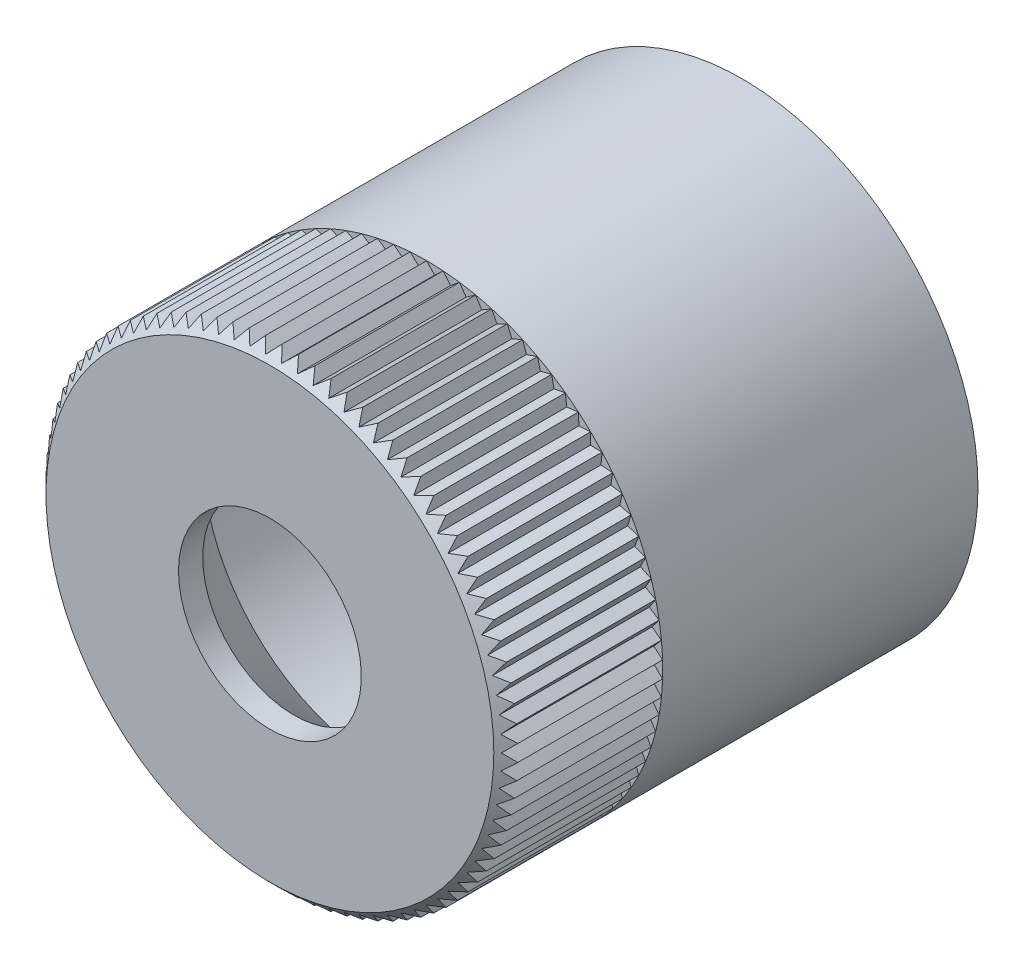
from build123d import *

# Parameters (mm, degrees)
SKETCH1_R           = 6.325
BOSS_EXTRUDE1_DEPTH = 12.65
SKETCH2_R           = 4.8
CUT_EXTRUDE1_DEPTH  = 9.65
SKETCH3_R           = 2.45
CUT_EXTRUDE2_DEPTH  = 14.158029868
CUT_EXTRUDE4_DEPTH  = 4.2
CIRPATTERN1_COUNT   = 90
CHAMFER1_SIZE       = 0.5
SKETCH7_R           = 0.8
SKETCH10_OUTSIDE_W  = 52.018
SKETCH10_OUTSIDE_H  = 52.018
SKETCH10_OUTSIDE_R  = 6
CUT_EXTRUDE7_DEPTH  = 16.493022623
CUT_EXTRUDE7_DRAFT  = -45


with BuildPart() as part:
    # Sketch1 → Boss-Extrude1 (new body)
    with BuildSketch(Plane.XY):
        Circle(SKETCH1_R)
    extrude(amount=BOSS_EXTRUDE1_DEPTH)

    # Sketch2 → Cut-Extrude1 (cut)
    with BuildSketch(Plane(origin=(0, 0, 0), x_dir=(-1, 0, 0), z_dir=(0, 0, -1))):
        Circle(SKETCH2_R)
    extrude(amount=-CUT_EXTRUDE1_DEPTH, mode=Mode.SUBTRACT)

    # Sketch3 → Cut-Extrude2 (cut, through all)
    with BuildSketch(Plane(origin=(0, 0, 9.65), x_dir=(-1, 0, 0), z_dir=(0, 0, -1))):
        Circle(SKETCH3_R)
    extrude(amount=-CUT_EXTRUDE2_DEPTH, mode=Mode.SUBTRACT)

    # Cut-Extrude3 cone 1 section (on through the dimple's axis) → Cut-Extrude3 (revolve, cut)
    with BuildSketch(Plane(origin=(0, 0, 9.65), x_dir=(0, 1, 0), z_dir=(1, 0, 0))):
        Polygon((0, 0), (4.8, 0), (0, 4.8), align=None)
    revolve(axis=Axis((0, 0, 9.65), (0, 0, 1)), mode=Mode.SUBTRACT)

    # Sketch5 → Cut-Extrude4 (cut)
    with BuildSketch(Plane.XY.offset(12.65)):
        with BuildLine():
            Line((0, 6.325), (0.212901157, 6.096691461))
            Line((0.212901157, 6.096691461), (0.441209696, 6.309592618))
            ThreePointArc((0.441209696, 6.309592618), (0.239203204, 6.849883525), (0, 6.325))
        make_face()
    cut_extrude4 = extrude(amount=-CUT_EXTRUDE4_DEPTH, mode=Mode.SUBTRACT)

    # CirPattern1: Cut-Extrude4 ×90 about axis
    cirpattern1_axis = Axis((0, 0, 0), (0, 0, 1))
    for i in range(1, CIRPATTERN1_COUNT):
        add(cut_extrude4.rotate(cirpattern1_axis, i * 360 / CIRPATTERN1_COUNT), mode=Mode.SUBTRACT)

    # Chamfer1
    chamfer1_edges = [part.edges().sort_by_distance(p)[0] for p in [
        (4.8, 0, 0),
    ]]
    chamfer(chamfer1_edges, length=CHAMFER1_SIZE)

    # Sketch7 → Cut-Revolve1 (revolve, cut)
    with BuildSketch(Plane(origin=(0, 0, 0), x_dir=(0, 0, -1), z_dir=(1, 0, 0)), mode=Mode.PRIVATE) as cut_revolve1_sk:
        with Locations((-1.8, 4.8)):
            Circle(SKETCH7_R)
    revolve(cut_revolve1_sk.sketch.rotate(Axis((0, 0, 12.65), (0, 0, -1)), 90), axis=Axis((0, 0, 12.65), (0, 0, -1)), mode=Mode.SUBTRACT)


with BuildPart() as cut_extrude7_tool:
    # Sketch10 outside → Cut-Extrude7 (with draft: the straight prism first)
    with BuildSketch(Plane.XY.offset(12.65)):
        Rectangle(SKETCH10_OUTSIDE_W, SKETCH10_OUTSIDE_H)
        Circle(SKETCH10_OUTSIDE_R, mode=Mode.SUBTRACT)
    extrude(amount=-CUT_EXTRUDE7_DEPTH)
    # Cut-Extrude7: the draft: its side faces are tilted about the plane it starts from
    cut_extrude7_sides = [cut_extrude7_tool.faces().sort_by_distance(p)[0] for p in [
        (0, -26.009, 4.403488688),
        (26.009, 0, 4.403488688),
        (0, 26.009, 4.403488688),
        (-26.009, 0, 4.403488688),
        (-6, 0, 4.403488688),
    ]]
    draft(cut_extrude7_sides, Plane.XY.offset(12.65), CUT_EXTRUDE7_DRAFT)


with BuildPart() as part_1:
    add(part.part)

    # Cut-Extrude7: cut by cut_extrude7_tool
    add(cut_extrude7_tool.part, mode=Mode.SUBTRACT)


solid = part_1.part
